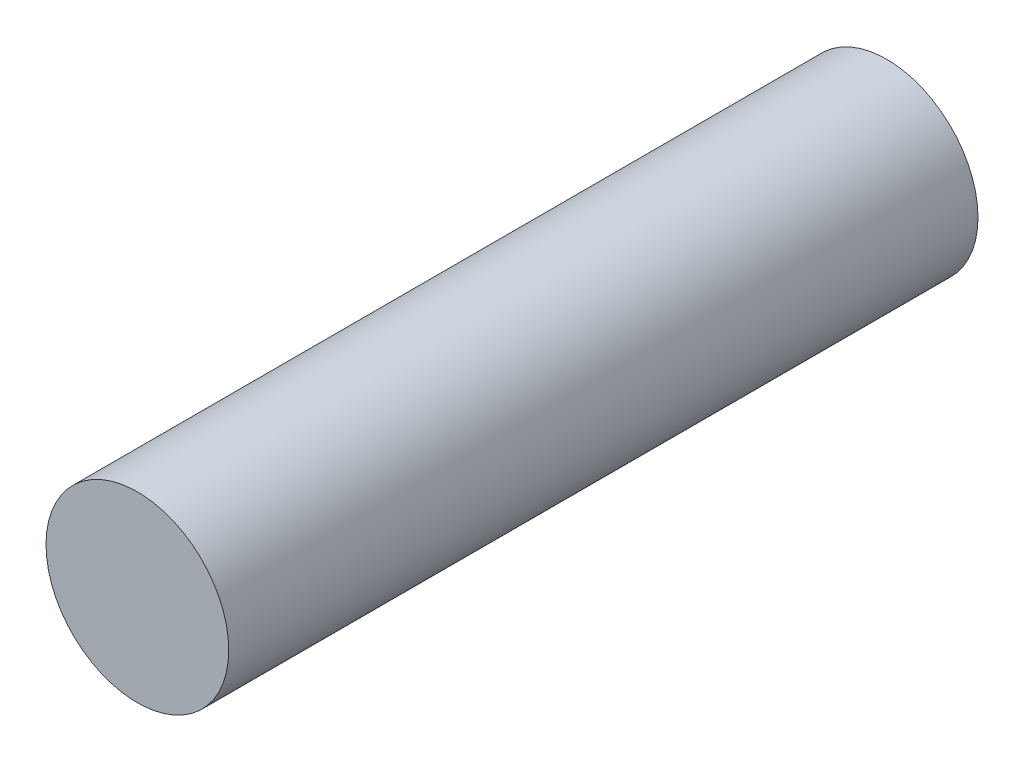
from build123d import *

# Parameters (mm, degrees)
ESQUISSE1_R                = 9.39
BASE_EXTRUSION_DEPTH       = 77
TROU_TARAUD_M10X1_51_D     = 8
TROU_TARAUD_M10X1_51_DEPTH = 51
TROU_TARAUD_M10X1_51_TIP   = 2.309401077


with BuildPart() as part:
    # Esquisse1 → Base-Extrusion (new body)
    with BuildSketch(Plane.XY):
        Circle(ESQUISSE1_R)
    extrude(amount=BASE_EXTRUSION_DEPTH)

    # Trou taraud_ M10x1.51
    with Locations(Plane(origin=(0, 0, 0), x_dir=(-1, 0, 0), z_dir=(0, 0, -1))):
        with Locations((0, 0)):
            Hole(TROU_TARAUD_M10X1_51_D / 2, depth=TROU_TARAUD_M10X1_51_DEPTH)
            with Locations((0, 0, -(TROU_TARAUD_M10X1_51_DEPTH + TROU_TARAUD_M10X1_51_TIP / 2))):  # 120° drill point
                Cone(0, TROU_TARAUD_M10X1_51_D / 2, TROU_TARAUD_M10X1_51_TIP, mode=Mode.SUBTRACT)


solid = part.part
